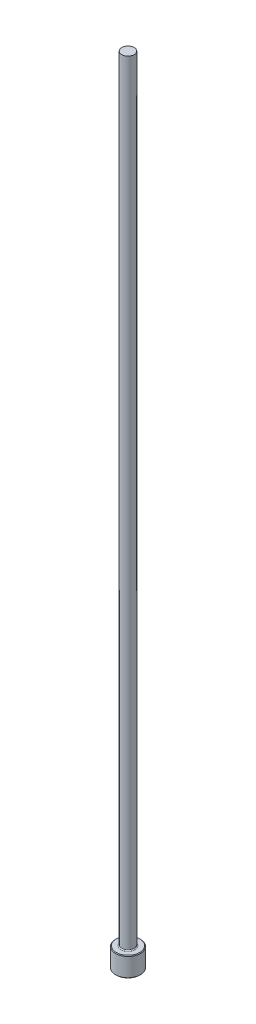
from build123d import *

# Parameters (mm, degrees)
CHAMFER1_SIZE = 0.0508
FILLET1_R     = 0.0762


with BuildPart() as part:
    # Sketch1 → Revolve1 (revolve)
    with BuildSketch(Plane.XY, mode=Mode.PRIVATE) as revolve1_sk:
        Polygon((0, 0), (-0.9906, 0), (-0.9906, 1.5748), (-0.4953, 1.5748), (-0.4953, 63.5), (0, 63.5), align=None)
    revolve(revolve1_sk.sketch.rotate(Axis((0, 259.958771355, 0), (0, -1, 0)), 270), axis=Axis((0, 259.958771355, 0), (0, -1, 0)))

    # Chamfer1
    chamfer1_edges = [part.edges().sort_by_distance(p)[0] for p in [
        (0, 1.5748, -0.9906),
        (0, 0, -0.9906),
    ]]
    chamfer(chamfer1_edges, length=CHAMFER1_SIZE)

    # Fillet1
    fillet1_edges = [part.edges().sort_by_distance(p)[0] for p in [
        (0, 1.5748, -0.4953),
    ]]
    fillet(fillet1_edges, radius=FILLET1_R)


solid = part.part
